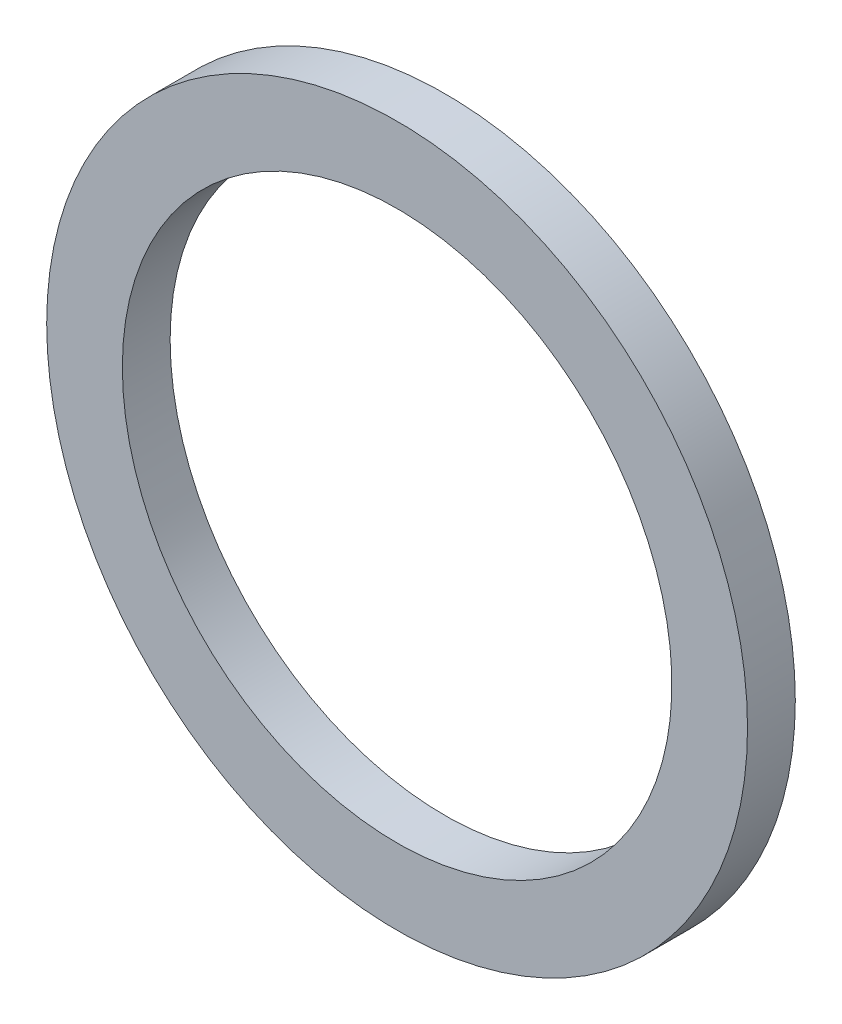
from build123d import *

# Parameters (mm, degrees)
SKETCH1_R          = 11
SKETCH1_R_2        = 8.625
BASE_EXTRUDE_DEPTH = 1.5


with BuildPart() as part:
    # Sketch1 → Base-Extrude (new body)
    with BuildSketch(Plane.XY):
        Circle(SKETCH1_R)
        Circle(SKETCH1_R_2, mode=Mode.SUBTRACT)
    extrude(amount=BASE_EXTRUDE_DEPTH)


solid = part.part
